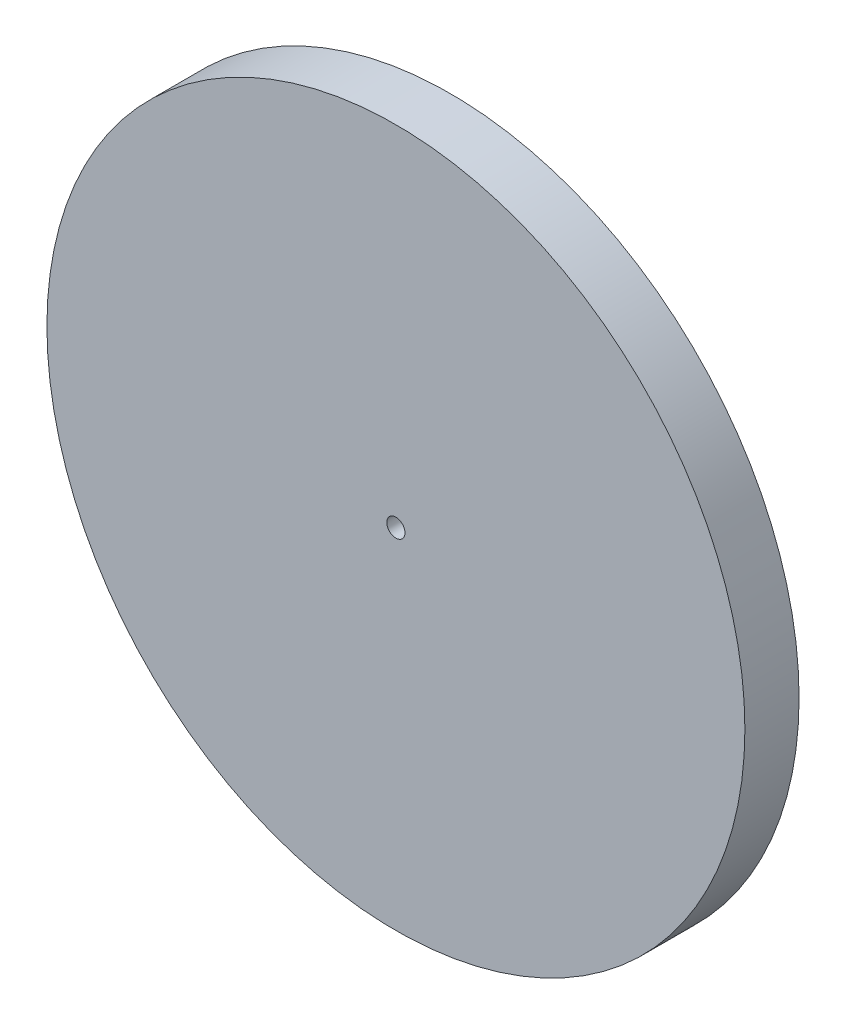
from build123d import *

# Parameters (mm, degrees)
SKETCH1_R          = 152.146
BASE_EXTRUDE_DEPTH = 23.622
SKETCH2_R          = 3.9624
CUT_EXTRUDE1_DEPTH = 217.459717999


with BuildPart() as part:
    # Sketch1 → Base-Extrude (new body)
    with BuildSketch(Plane.XY):
        Circle(SKETCH1_R)
    extrude(amount=-BASE_EXTRUDE_DEPTH)

    # Sketch2 → Cut-Extrude1 (cut, through all)
    with BuildSketch(Plane.XY):
        Circle(SKETCH2_R)
    extrude(amount=-CUT_EXTRUDE1_DEPTH, mode=Mode.SUBTRACT)


solid = part.part
